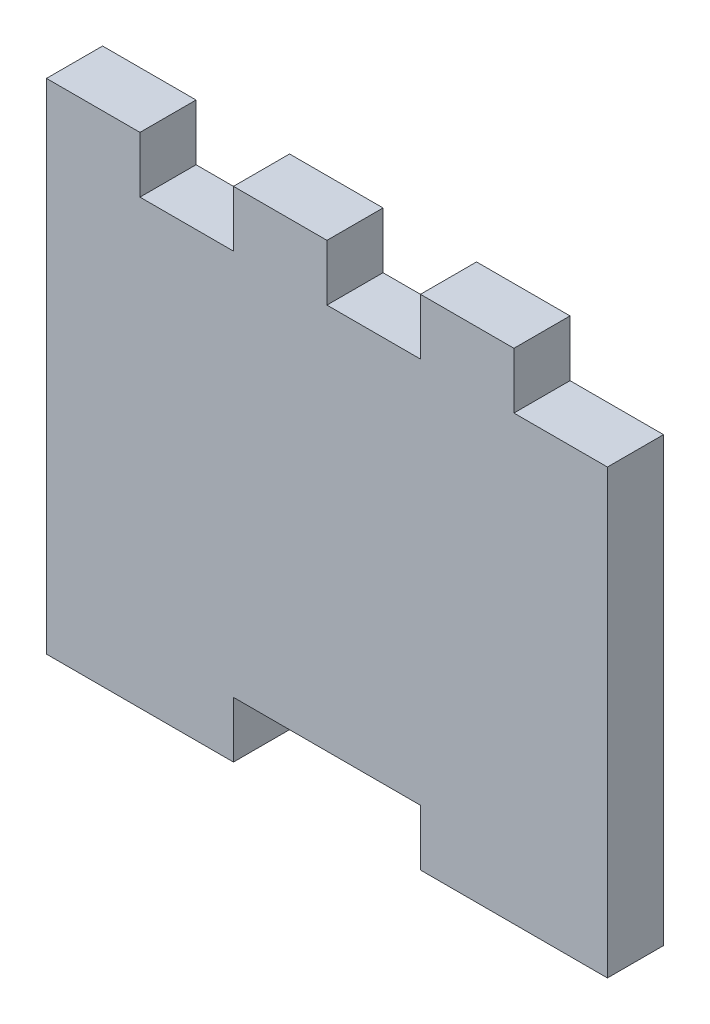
ISO-10303-21;
HEADER;
FILE_DESCRIPTION(('STEP AP214'),'2;1');
FILE_NAME('part.step','',(''),(''),'','','');
FILE_SCHEMA(('AUTOMOTIVE_DESIGN { 1 0 10303 214 1 1 1 1 }'));
ENDSEC;
DATA;
#1=APPLICATION_CONTEXT('core data for automotive mechanical design processes');
#2=APPLICATION_PROTOCOL_DEFINITION('international standard','automotive_design',2000,#1);
#3=PRODUCT_CONTEXT('',#1,'mechanical');
#4=PRODUCT('Part','Part','',(#3));
#5=PRODUCT_RELATED_PRODUCT_CATEGORY('part','',(#4));
#6=PRODUCT_DEFINITION_FORMATION('','',#4);
#7=PRODUCT_DEFINITION_CONTEXT('part definition',#1,'design');
#8=PRODUCT_DEFINITION('design','',#6,#7);
#9=PRODUCT_DEFINITION_SHAPE('','',#8);
#10=(LENGTH_UNIT() NAMED_UNIT(*) SI_UNIT(.MILLI.,.METRE.));
#11=(NAMED_UNIT(*) PLANE_ANGLE_UNIT() SI_UNIT($,.RADIAN.));
#12=(NAMED_UNIT(*) SI_UNIT($,.STERADIAN.) SOLID_ANGLE_UNIT());
#13=UNCERTAINTY_MEASURE_WITH_UNIT(LENGTH_MEASURE(1.E-05),#10,'distance_accuracy_value','');
#14=(GEOMETRIC_REPRESENTATION_CONTEXT(3) GLOBAL_UNCERTAINTY_ASSIGNED_CONTEXT((#13)) GLOBAL_UNIT_ASSIGNED_CONTEXT((#10,
#11,#12)) REPRESENTATION_CONTEXT('',''));
#15=CARTESIAN_POINT('',(0.,0.,0.));
#16=DIRECTION('',(0.,0.,1.));
#17=DIRECTION('',(1.,0.,0.));
#18=AXIS2_PLACEMENT_3D('',#15,#16,#17);
#19=CARTESIAN_POINT('',(-141.621289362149,98.5259670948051,9.));
#20=DIRECTION('',(0.,1.,0.));
#21=DIRECTION('',(-1.,0.,0.));
#22=AXIS2_PLACEMENT_3D('',#19,#20,#21);
#23=PLANE('',#22);
#24=DIRECTION('',(1.,0.,0.));
#25=VECTOR('',#24,1.);
#26=CARTESIAN_POINT('',(-141.621289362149,98.5259670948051,0.));
#27=LINE('',#26,#25);
#28=CARTESIAN_POINT('',(-141.621289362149,98.5259670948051,0.));
#29=VERTEX_POINT('',#28);
#30=CARTESIAN_POINT('',(-111.621289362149,98.5259670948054,0.));
#31=VERTEX_POINT('',#30);
#32=EDGE_CURVE('E192',#29,#31,#27,.T.);
#33=ORIENTED_EDGE('',*,*,#32,.T.);
#34=DIRECTION('',(0.,0.,-1.));
#35=VECTOR('',#34,1.);
#36=CARTESIAN_POINT('',(-111.621289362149,98.5259670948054,9.));
#37=LINE('',#36,#35);
#38=CARTESIAN_POINT('',(-111.621289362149,98.5259670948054,9.));
#39=VERTEX_POINT('',#38);
#40=EDGE_CURVE('E11',#39,#31,#37,.T.);
#41=ORIENTED_EDGE('',*,*,#40,.F.);
#42=DIRECTION('',(1.,0.,0.));
#43=VECTOR('',#42,1.);
#44=CARTESIAN_POINT('',(-141.621289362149,98.5259670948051,9.));
#45=LINE('',#44,#43);
#46=CARTESIAN_POINT('',(-141.621289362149,98.5259670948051,9.));
#47=VERTEX_POINT('',#46);
#48=EDGE_CURVE('E238',#47,#39,#45,.T.);
#49=ORIENTED_EDGE('',*,*,#48,.F.);
#50=DIRECTION('',(0.,0.,-1.));
#51=VECTOR('',#50,1.);
#52=CARTESIAN_POINT('',(-141.621289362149,98.5259670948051,9.));
#53=LINE('',#52,#51);
#54=EDGE_CURVE('E51',#47,#29,#53,.T.);
#55=ORIENTED_EDGE('',*,*,#54,.T.);
#56=EDGE_LOOP('',(#33,#41,#49,#55));
#57=FACE_BOUND('',#56,.T.);
#58=ADVANCED_FACE('F35',(#57),#23,.F.);
#59=CARTESIAN_POINT('',(-111.621289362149,98.5259670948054,9.));
#60=DIRECTION('',(-1.,0.,0.));
#61=DIRECTION('',(0.,-1.,0.));
#62=AXIS2_PLACEMENT_3D('',#59,#60,#61);
#63=PLANE('',#62);
#64=DIRECTION('',(0.,1.,0.));
#65=VECTOR('',#64,1.);
#66=CARTESIAN_POINT('',(-111.621289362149,98.5259670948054,0.));
#67=LINE('',#66,#65);
#68=CARTESIAN_POINT('',(-111.621289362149,107.525967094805,0.));
#69=VERTEX_POINT('',#68);
#70=EDGE_CURVE('E194',#31,#69,#67,.T.);
#71=ORIENTED_EDGE('',*,*,#70,.T.);
#72=DIRECTION('',(0.,0.,-1.));
#73=VECTOR('',#72,1.);
#74=CARTESIAN_POINT('',(-111.621289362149,107.525967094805,9.));
#75=LINE('',#74,#73);
#76=CARTESIAN_POINT('',(-111.621289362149,107.525967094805,9.));
#77=VERTEX_POINT('',#76);
#78=EDGE_CURVE('E43',#77,#69,#75,.T.);
#79=ORIENTED_EDGE('',*,*,#78,.F.);
#80=DIRECTION('',(0.,1.,0.));
#81=VECTOR('',#80,1.);
#82=CARTESIAN_POINT('',(-111.621289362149,98.5259670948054,9.));
#83=LINE('',#82,#81);
#84=EDGE_CURVE('E119',#39,#77,#83,.T.);
#85=ORIENTED_EDGE('',*,*,#84,.F.);
#86=ORIENTED_EDGE('',*,*,#40,.T.);
#87=EDGE_LOOP('',(#71,#79,#85,#86));
#88=FACE_BOUND('',#87,.T.);
#89=ADVANCED_FACE('F335',(#88),#63,.F.);
#90=CARTESIAN_POINT('',(-111.621289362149,107.525967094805,9.));
#91=DIRECTION('',(0.,1.,0.));
#92=DIRECTION('',(-1.,0.,0.));
#93=AXIS2_PLACEMENT_3D('',#90,#91,#92);
#94=PLANE('',#93);
#95=DIRECTION('',(1.,0.,0.));
#96=VECTOR('',#95,1.);
#97=CARTESIAN_POINT('',(-111.621289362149,107.525967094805,0.));
#98=LINE('',#97,#96);
#99=CARTESIAN_POINT('',(-81.621289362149,107.525967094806,0.));
#100=VERTEX_POINT('',#99);
#101=EDGE_CURVE('E196',#69,#100,#98,.T.);
#102=ORIENTED_EDGE('',*,*,#101,.T.);
#103=DIRECTION('',(0.,0.,-1.));
#104=VECTOR('',#103,1.);
#105=CARTESIAN_POINT('',(-81.621289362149,107.525967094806,9.));
#106=LINE('',#105,#104);
#107=CARTESIAN_POINT('',(-81.621289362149,107.525967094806,9.));
#108=VERTEX_POINT('',#107);
#109=EDGE_CURVE('E266',#108,#100,#106,.T.);
#110=ORIENTED_EDGE('',*,*,#109,.F.);
#111=DIRECTION('',(1.,0.,0.));
#112=VECTOR('',#111,1.);
#113=CARTESIAN_POINT('',(-111.621289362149,107.525967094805,9.));
#114=LINE('',#113,#112);
#115=EDGE_CURVE('E274',#77,#108,#114,.T.);
#116=ORIENTED_EDGE('',*,*,#115,.F.);
#117=ORIENTED_EDGE('',*,*,#78,.T.);
#118=EDGE_LOOP('',(#102,#110,#116,#117));
#119=FACE_BOUND('',#118,.T.);
#120=ADVANCED_FACE('F272',(#119),#94,.F.);
#121=CARTESIAN_POINT('',(-81.621289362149,107.525967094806,9.));
#122=DIRECTION('',(1.,0.,0.));
#123=DIRECTION('',(0.,1.,0.));
#124=AXIS2_PLACEMENT_3D('',#121,#122,#123);
#125=PLANE('',#124);
#126=DIRECTION('',(0.,-1.,0.));
#127=VECTOR('',#126,1.);
#128=CARTESIAN_POINT('',(-81.621289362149,107.525967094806,0.));
#129=LINE('',#128,#127);
#130=CARTESIAN_POINT('',(-81.6212893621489,98.5259670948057,0.));
#131=VERTEX_POINT('',#130);
#132=EDGE_CURVE('E198',#100,#131,#129,.T.);
#133=ORIENTED_EDGE('',*,*,#132,.T.);
#134=DIRECTION('',(0.,0.,-1.));
#135=VECTOR('',#134,1.);
#136=CARTESIAN_POINT('',(-81.6212893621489,98.5259670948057,9.));
#137=LINE('',#136,#135);
#138=CARTESIAN_POINT('',(-81.6212893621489,98.5259670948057,9.));
#139=VERTEX_POINT('',#138);
#140=EDGE_CURVE('E263',#139,#131,#137,.T.);
#141=ORIENTED_EDGE('',*,*,#140,.F.);
#142=DIRECTION('',(0.,-1.,0.));
#143=VECTOR('',#142,1.);
#144=CARTESIAN_POINT('',(-81.621289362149,107.525967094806,9.));
#145=LINE('',#144,#143);
#146=EDGE_CURVE('E291',#108,#139,#145,.T.);
#147=ORIENTED_EDGE('',*,*,#146,.F.);
#148=ORIENTED_EDGE('',*,*,#109,.T.);
#149=EDGE_LOOP('',(#133,#141,#147,#148));
#150=FACE_BOUND('',#149,.T.);
#151=ADVANCED_FACE('F282',(#150),#125,.F.);
#152=CARTESIAN_POINT('',(-81.6212893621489,98.5259670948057,9.));
#153=DIRECTION('',(0.,1.,0.));
#154=DIRECTION('',(-1.,0.,0.));
#155=AXIS2_PLACEMENT_3D('',#152,#153,#154);
#156=PLANE('',#155);
#157=DIRECTION('',(1.,0.,0.));
#158=VECTOR('',#157,1.);
#159=CARTESIAN_POINT('',(-81.6212893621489,98.5259670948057,0.));
#160=LINE('',#159,#158);
#161=CARTESIAN_POINT('',(-51.6212893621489,98.525967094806,0.));
#162=VERTEX_POINT('',#161);
#163=EDGE_CURVE('E200',#131,#162,#160,.T.);
#164=ORIENTED_EDGE('',*,*,#163,.T.);
#165=DIRECTION('',(0.,0.,-1.));
#166=VECTOR('',#165,1.);
#167=CARTESIAN_POINT('',(-51.6212893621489,98.525967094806,9.));
#168=LINE('',#167,#166);
#169=CARTESIAN_POINT('',(-51.6212893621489,98.525967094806,9.));
#170=VERTEX_POINT('',#169);
#171=EDGE_CURVE('E260',#170,#162,#168,.T.);
#172=ORIENTED_EDGE('',*,*,#171,.F.);
#173=DIRECTION('',(1.,0.,0.));
#174=VECTOR('',#173,1.);
#175=CARTESIAN_POINT('',(-81.6212893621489,98.5259670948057,9.));
#176=LINE('',#175,#174);
#177=EDGE_CURVE('E288',#139,#170,#176,.T.);
#178=ORIENTED_EDGE('',*,*,#177,.F.);
#179=ORIENTED_EDGE('',*,*,#140,.T.);
#180=EDGE_LOOP('',(#164,#172,#178,#179));
#181=FACE_BOUND('',#180,.T.);
#182=ADVANCED_FACE('F286',(#181),#156,.F.);
#183=CARTESIAN_POINT('',(-51.6212893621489,98.525967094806,9.));
#184=DIRECTION('',(-1.,0.,0.));
#185=DIRECTION('',(0.,0.,1.));
#186=AXIS2_PLACEMENT_3D('',#183,#184,#185);
#187=PLANE('',#186);
#188=DIRECTION('',(0.,1.,0.));
#189=VECTOR('',#188,1.);
#190=CARTESIAN_POINT('',(-51.6212893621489,98.525967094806,0.));
#191=LINE('',#190,#189);
#192=CARTESIAN_POINT('',(-51.6212893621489,169.525967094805,0.));
#193=VERTEX_POINT('',#192);
#194=EDGE_CURVE('E202',#162,#193,#191,.T.);
#195=ORIENTED_EDGE('',*,*,#194,.T.);
#196=DIRECTION('',(0.,0.,-1.));
#197=VECTOR('',#196,1.);
#198=CARTESIAN_POINT('',(-51.6212893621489,169.525967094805,9.));
#199=LINE('',#198,#197);
#200=CARTESIAN_POINT('',(-51.6212893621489,169.525967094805,9.));
#201=VERTEX_POINT('',#200);
#202=EDGE_CURVE('E258',#201,#193,#199,.T.);
#203=ORIENTED_EDGE('',*,*,#202,.F.);
#204=DIRECTION('',(0.,1.,0.));
#205=VECTOR('',#204,1.);
#206=CARTESIAN_POINT('',(-51.6212893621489,98.525967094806,9.));
#207=LINE('',#206,#205);
#208=EDGE_CURVE('E290',#170,#201,#207,.T.);
#209=ORIENTED_EDGE('',*,*,#208,.F.);
#210=ORIENTED_EDGE('',*,*,#171,.T.);
#211=EDGE_LOOP('',(#195,#203,#209,#210));
#212=FACE_BOUND('',#211,.T.);
#213=ADVANCED_FACE('F351',(#212),#187,.F.);
#214=CARTESIAN_POINT('',(-66.6212893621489,169.525967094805,9.));
#215=DIRECTION('',(0.,1.,0.));
#216=DIRECTION('',(0.,0.,1.));
#217=AXIS2_PLACEMENT_3D('',#214,#215,#216);
#218=PLANE('',#217);
#219=DIRECTION('',(1.,0.,0.));
#220=VECTOR('',#219,1.);
#221=CARTESIAN_POINT('',(-66.6212893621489,169.525967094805,0.));
#222=LINE('',#221,#220);
#223=CARTESIAN_POINT('',(-66.6212893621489,169.525967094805,0.));
#224=VERTEX_POINT('',#223);
#225=EDGE_CURVE('E205',#224,#193,#222,.T.);
#226=ORIENTED_EDGE('',*,*,#225,.F.);
#227=DIRECTION('',(0.,0.,-1.));
#228=VECTOR('',#227,1.);
#229=CARTESIAN_POINT('',(-66.6212893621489,169.525967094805,9.));
#230=LINE('',#229,#228);
#231=CARTESIAN_POINT('',(-66.6212893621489,169.525967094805,9.));
#232=VERTEX_POINT('',#231);
#233=EDGE_CURVE('E256',#232,#224,#230,.T.);
#234=ORIENTED_EDGE('',*,*,#233,.F.);
#235=DIRECTION('',(1.,0.,0.));
#236=VECTOR('',#235,1.);
#237=CARTESIAN_POINT('',(-66.6212893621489,169.525967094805,9.));
#238=LINE('',#237,#236);
#239=EDGE_CURVE('E293',#232,#201,#238,.T.);
#240=ORIENTED_EDGE('',*,*,#239,.T.);
#241=ORIENTED_EDGE('',*,*,#202,.T.);
#242=EDGE_LOOP('',(#226,#234,#240,#241));
#243=FACE_BOUND('',#242,.T.);
#244=ADVANCED_FACE('F354',(#243),#218,.T.);
#245=CARTESIAN_POINT('',(-66.6212893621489,178.525967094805,9.));
#246=DIRECTION('',(1.,0.,0.));
#247=DIRECTION('',(0.,0.,-1.));
#248=AXIS2_PLACEMENT_3D('',#245,#246,#247);
#249=PLANE('',#248);
#250=DIRECTION('',(0.,-1.,0.));
#251=VECTOR('',#250,1.);
#252=CARTESIAN_POINT('',(-66.6212893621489,178.525967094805,0.));
#253=LINE('',#252,#251);
#254=CARTESIAN_POINT('',(-66.6212893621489,178.525967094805,0.));
#255=VERTEX_POINT('',#254);
#256=EDGE_CURVE('E208',#255,#224,#253,.T.);
#257=ORIENTED_EDGE('',*,*,#256,.F.);
#258=DIRECTION('',(0.,0.,-1.));
#259=VECTOR('',#258,1.);
#260=CARTESIAN_POINT('',(-66.6212893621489,178.525967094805,9.));
#261=LINE('',#260,#259);
#262=CARTESIAN_POINT('',(-66.6212893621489,178.525967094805,9.));
#263=VERTEX_POINT('',#262);
#264=EDGE_CURVE('E254',#263,#255,#261,.T.);
#265=ORIENTED_EDGE('',*,*,#264,.F.);
#266=DIRECTION('',(0.,-1.,0.));
#267=VECTOR('',#266,1.);
#268=CARTESIAN_POINT('',(-66.6212893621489,178.525967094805,9.));
#269=LINE('',#268,#267);
#270=EDGE_CURVE('E300',#263,#232,#269,.T.);
#271=ORIENTED_EDGE('',*,*,#270,.T.);
#272=ORIENTED_EDGE('',*,*,#233,.T.);
#273=EDGE_LOOP('',(#257,#265,#271,#272));
#274=FACE_BOUND('',#273,.T.);
#275=ADVANCED_FACE('F358',(#274),#249,.T.);
#276=CARTESIAN_POINT('',(-81.621289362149,178.525967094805,9.));
#277=DIRECTION('',(0.,1.,0.));
#278=DIRECTION('',(0.,0.,1.));
#279=AXIS2_PLACEMENT_3D('',#276,#277,#278);
#280=PLANE('',#279);
#281=DIRECTION('',(1.,0.,0.));
#282=VECTOR('',#281,1.);
#283=CARTESIAN_POINT('',(-81.621289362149,178.525967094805,0.));
#284=LINE('',#283,#282);
#285=CARTESIAN_POINT('',(-81.621289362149,178.525967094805,0.));
#286=VERTEX_POINT('',#285);
#287=EDGE_CURVE('E211',#286,#255,#284,.T.);
#288=ORIENTED_EDGE('',*,*,#287,.F.);
#289=DIRECTION('',(0.,0.,-1.));
#290=VECTOR('',#289,1.);
#291=CARTESIAN_POINT('',(-81.621289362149,178.525967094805,9.));
#292=LINE('',#291,#290);
#293=CARTESIAN_POINT('',(-81.621289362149,178.525967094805,9.));
#294=VERTEX_POINT('',#293);
#295=EDGE_CURVE('E252',#294,#286,#292,.T.);
#296=ORIENTED_EDGE('',*,*,#295,.F.);
#297=DIRECTION('',(1.,0.,0.));
#298=VECTOR('',#297,1.);
#299=CARTESIAN_POINT('',(-81.621289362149,178.525967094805,9.));
#300=LINE('',#299,#298);
#301=EDGE_CURVE('E303',#294,#263,#300,.T.);
#302=ORIENTED_EDGE('',*,*,#301,.T.);
#303=ORIENTED_EDGE('',*,*,#264,.T.);
#304=EDGE_LOOP('',(#288,#296,#302,#303));
#305=FACE_BOUND('',#304,.T.);
#306=ADVANCED_FACE('F362',(#305),#280,.T.);
#307=CARTESIAN_POINT('',(-81.621289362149,169.525967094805,9.));
#308=DIRECTION('',(-1.,0.,0.));
#309=DIRECTION('',(0.,0.,1.));
#310=AXIS2_PLACEMENT_3D('',#307,#308,#309);
#311=PLANE('',#310);
#312=DIRECTION('',(0.,1.,0.));
#313=VECTOR('',#312,1.);
#314=CARTESIAN_POINT('',(-81.621289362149,169.525967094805,0.));
#315=LINE('',#314,#313);
#316=CARTESIAN_POINT('',(-81.621289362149,169.525967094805,0.));
#317=VERTEX_POINT('',#316);
#318=EDGE_CURVE('E214',#317,#286,#315,.T.);
#319=ORIENTED_EDGE('',*,*,#318,.F.);
#320=DIRECTION('',(0.,0.,-1.));
#321=VECTOR('',#320,1.);
#322=CARTESIAN_POINT('',(-81.621289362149,169.525967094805,9.));
#323=LINE('',#322,#321);
#324=CARTESIAN_POINT('',(-81.621289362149,169.525967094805,9.));
#325=VERTEX_POINT('',#324);
#326=EDGE_CURVE('E250',#325,#317,#323,.T.);
#327=ORIENTED_EDGE('',*,*,#326,.F.);
#328=DIRECTION('',(0.,1.,0.));
#329=VECTOR('',#328,1.);
#330=CARTESIAN_POINT('',(-81.621289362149,169.525967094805,9.));
#331=LINE('',#330,#329);
#332=EDGE_CURVE('E306',#325,#294,#331,.T.);
#333=ORIENTED_EDGE('',*,*,#332,.T.);
#334=ORIENTED_EDGE('',*,*,#295,.T.);
#335=EDGE_LOOP('',(#319,#327,#333,#334));
#336=FACE_BOUND('',#335,.T.);
#337=ADVANCED_FACE('F366',(#336),#311,.T.);
#338=CARTESIAN_POINT('',(-96.6212893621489,169.525967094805,9.));
#339=DIRECTION('',(0.,1.,0.));
#340=DIRECTION('',(0.,0.,1.));
#341=AXIS2_PLACEMENT_3D('',#338,#339,#340);
#342=PLANE('',#341);
#343=DIRECTION('',(1.,0.,0.));
#344=VECTOR('',#343,1.);
#345=CARTESIAN_POINT('',(-96.6212893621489,169.525967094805,0.));
#346=LINE('',#345,#344);
#347=CARTESIAN_POINT('',(-96.6212893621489,169.525967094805,0.));
#348=VERTEX_POINT('',#347);
#349=EDGE_CURVE('E217',#348,#317,#346,.T.);
#350=ORIENTED_EDGE('',*,*,#349,.F.);
#351=DIRECTION('',(0.,0.,-1.));
#352=VECTOR('',#351,1.);
#353=CARTESIAN_POINT('',(-96.6212893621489,169.525967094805,9.));
#354=LINE('',#353,#352);
#355=CARTESIAN_POINT('',(-96.6212893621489,169.525967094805,9.));
#356=VERTEX_POINT('',#355);
#357=EDGE_CURVE('E248',#356,#348,#354,.T.);
#358=ORIENTED_EDGE('',*,*,#357,.F.);
#359=DIRECTION('',(1.,0.,0.));
#360=VECTOR('',#359,1.);
#361=CARTESIAN_POINT('',(-96.6212893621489,169.525967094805,9.));
#362=LINE('',#361,#360);
#363=EDGE_CURVE('E309',#356,#325,#362,.T.);
#364=ORIENTED_EDGE('',*,*,#363,.T.);
#365=ORIENTED_EDGE('',*,*,#326,.T.);
#366=EDGE_LOOP('',(#350,#358,#364,#365));
#367=FACE_BOUND('',#366,.T.);
#368=ADVANCED_FACE('F370',(#367),#342,.T.);
#369=CARTESIAN_POINT('',(-96.6212893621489,178.525967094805,9.));
#370=DIRECTION('',(1.,0.,0.));
#371=DIRECTION('',(0.,0.,-1.));
#372=AXIS2_PLACEMENT_3D('',#369,#370,#371);
#373=PLANE('',#372);
#374=DIRECTION('',(0.,-1.,0.));
#375=VECTOR('',#374,1.);
#376=CARTESIAN_POINT('',(-96.6212893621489,178.525967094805,0.));
#377=LINE('',#376,#375);
#378=CARTESIAN_POINT('',(-96.6212893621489,178.525967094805,0.));
#379=VERTEX_POINT('',#378);
#380=EDGE_CURVE('E220',#379,#348,#377,.T.);
#381=ORIENTED_EDGE('',*,*,#380,.F.);
#382=DIRECTION('',(0.,0.,-1.));
#383=VECTOR('',#382,1.);
#384=CARTESIAN_POINT('',(-96.6212893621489,178.525967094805,9.));
#385=LINE('',#384,#383);
#386=CARTESIAN_POINT('',(-96.6212893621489,178.525967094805,9.));
#387=VERTEX_POINT('',#386);
#388=EDGE_CURVE('E246',#387,#379,#385,.T.);
#389=ORIENTED_EDGE('',*,*,#388,.F.);
#390=DIRECTION('',(0.,-1.,0.));
#391=VECTOR('',#390,1.);
#392=CARTESIAN_POINT('',(-96.6212893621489,178.525967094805,9.));
#393=LINE('',#392,#391);
#394=EDGE_CURVE('E312',#387,#356,#393,.T.);
#395=ORIENTED_EDGE('',*,*,#394,.T.);
#396=ORIENTED_EDGE('',*,*,#357,.T.);
#397=EDGE_LOOP('',(#381,#389,#395,#396));
#398=FACE_BOUND('',#397,.T.);
#399=ADVANCED_FACE('F374',(#398),#373,.T.);
#400=CARTESIAN_POINT('',(-111.621289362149,178.525967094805,9.));
#401=DIRECTION('',(0.,1.,0.));
#402=DIRECTION('',(0.,0.,1.));
#403=AXIS2_PLACEMENT_3D('',#400,#401,#402);
#404=PLANE('',#403);
#405=DIRECTION('',(1.,0.,0.));
#406=VECTOR('',#405,1.);
#407=CARTESIAN_POINT('',(-111.621289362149,178.525967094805,0.));
#408=LINE('',#407,#406);
#409=CARTESIAN_POINT('',(-111.621289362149,178.525967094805,0.));
#410=VERTEX_POINT('',#409);
#411=EDGE_CURVE('E223',#410,#379,#408,.T.);
#412=ORIENTED_EDGE('',*,*,#411,.F.);
#413=DIRECTION('',(0.,0.,-1.));
#414=VECTOR('',#413,1.);
#415=CARTESIAN_POINT('',(-111.621289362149,178.525967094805,9.));
#416=LINE('',#415,#414);
#417=CARTESIAN_POINT('',(-111.621289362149,178.525967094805,9.));
#418=VERTEX_POINT('',#417);
#419=EDGE_CURVE('E244',#418,#410,#416,.T.);
#420=ORIENTED_EDGE('',*,*,#419,.F.);
#421=DIRECTION('',(1.,0.,0.));
#422=VECTOR('',#421,1.);
#423=CARTESIAN_POINT('',(-111.621289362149,178.525967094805,9.));
#424=LINE('',#423,#422);
#425=EDGE_CURVE('E315',#418,#387,#424,.T.);
#426=ORIENTED_EDGE('',*,*,#425,.T.);
#427=ORIENTED_EDGE('',*,*,#388,.T.);
#428=EDGE_LOOP('',(#412,#420,#426,#427));
#429=FACE_BOUND('',#428,.T.);
#430=ADVANCED_FACE('F378',(#429),#404,.T.);
#431=CARTESIAN_POINT('',(-111.621289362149,169.525967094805,9.));
#432=DIRECTION('',(-1.,0.,0.));
#433=DIRECTION('',(0.,0.,1.));
#434=AXIS2_PLACEMENT_3D('',#431,#432,#433);
#435=PLANE('',#434);
#436=DIRECTION('',(0.,1.,0.));
#437=VECTOR('',#436,1.);
#438=CARTESIAN_POINT('',(-111.621289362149,169.525967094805,0.));
#439=LINE('',#438,#437);
#440=CARTESIAN_POINT('',(-111.621289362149,169.525967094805,0.));
#441=VERTEX_POINT('',#440);
#442=EDGE_CURVE('E226',#441,#410,#439,.T.);
#443=ORIENTED_EDGE('',*,*,#442,.F.);
#444=DIRECTION('',(0.,0.,-1.));
#445=VECTOR('',#444,1.);
#446=CARTESIAN_POINT('',(-111.621289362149,169.525967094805,9.));
#447=LINE('',#446,#445);
#448=CARTESIAN_POINT('',(-111.621289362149,169.525967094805,9.));
#449=VERTEX_POINT('',#448);
#450=EDGE_CURVE('E242',#449,#441,#447,.T.);
#451=ORIENTED_EDGE('',*,*,#450,.F.);
#452=DIRECTION('',(0.,1.,0.));
#453=VECTOR('',#452,1.);
#454=CARTESIAN_POINT('',(-111.621289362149,169.525967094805,9.));
#455=LINE('',#454,#453);
#456=EDGE_CURVE('E318',#449,#418,#455,.T.);
#457=ORIENTED_EDGE('',*,*,#456,.T.);
#458=ORIENTED_EDGE('',*,*,#419,.T.);
#459=EDGE_LOOP('',(#443,#451,#457,#458));
#460=FACE_BOUND('',#459,.T.);
#461=ADVANCED_FACE('F382',(#460),#435,.T.);
#462=CARTESIAN_POINT('',(-126.621289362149,169.525967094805,9.));
#463=DIRECTION('',(0.,1.,0.));
#464=DIRECTION('',(0.,0.,1.));
#465=AXIS2_PLACEMENT_3D('',#462,#463,#464);
#466=PLANE('',#465);
#467=DIRECTION('',(1.,0.,0.));
#468=VECTOR('',#467,1.);
#469=CARTESIAN_POINT('',(-126.621289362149,169.525967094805,0.));
#470=LINE('',#469,#468);
#471=CARTESIAN_POINT('',(-126.621289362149,169.525967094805,0.));
#472=VERTEX_POINT('',#471);
#473=EDGE_CURVE('E229',#472,#441,#470,.T.);
#474=ORIENTED_EDGE('',*,*,#473,.F.);
#475=DIRECTION('',(0.,0.,-1.));
#476=VECTOR('',#475,1.);
#477=CARTESIAN_POINT('',(-126.621289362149,169.525967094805,9.));
#478=LINE('',#477,#476);
#479=CARTESIAN_POINT('',(-126.621289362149,169.525967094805,9.));
#480=VERTEX_POINT('',#479);
#481=EDGE_CURVE('E174',#480,#472,#478,.T.);
#482=ORIENTED_EDGE('',*,*,#481,.F.);
#483=DIRECTION('',(1.,0.,0.));
#484=VECTOR('',#483,1.);
#485=CARTESIAN_POINT('',(-126.621289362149,169.525967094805,9.));
#486=LINE('',#485,#484);
#487=EDGE_CURVE('E184',#480,#449,#486,.T.);
#488=ORIENTED_EDGE('',*,*,#487,.T.);
#489=ORIENTED_EDGE('',*,*,#450,.T.);
#490=EDGE_LOOP('',(#474,#482,#488,#489));
#491=FACE_BOUND('',#490,.T.);
#492=ADVANCED_FACE('F322',(#491),#466,.T.);
#493=CARTESIAN_POINT('',(-126.621289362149,178.525967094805,9.));
#494=DIRECTION('',(1.,0.,0.));
#495=DIRECTION('',(0.,0.,-1.));
#496=AXIS2_PLACEMENT_3D('',#493,#494,#495);
#497=PLANE('',#496);
#498=DIRECTION('',(0.,-1.,0.));
#499=VECTOR('',#498,1.);
#500=CARTESIAN_POINT('',(-126.621289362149,178.525967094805,0.));
#501=LINE('',#500,#499);
#502=CARTESIAN_POINT('',(-126.621289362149,178.525967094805,0.));
#503=VERTEX_POINT('',#502);
#504=EDGE_CURVE('E170',#503,#472,#501,.T.);
#505=ORIENTED_EDGE('',*,*,#504,.F.);
#506=DIRECTION('',(0.,0.,-1.));
#507=VECTOR('',#506,1.);
#508=CARTESIAN_POINT('',(-126.621289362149,178.525967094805,9.));
#509=LINE('',#508,#507);
#510=CARTESIAN_POINT('',(-126.621289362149,178.525967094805,9.));
#511=VERTEX_POINT('',#510);
#512=EDGE_CURVE('E165',#511,#503,#509,.T.);
#513=ORIENTED_EDGE('',*,*,#512,.F.);
#514=DIRECTION('',(0.,-1.,0.));
#515=VECTOR('',#514,1.);
#516=CARTESIAN_POINT('',(-126.621289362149,178.525967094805,9.));
#517=LINE('',#516,#515);
#518=EDGE_CURVE('E168',#511,#480,#517,.T.);
#519=ORIENTED_EDGE('',*,*,#518,.T.);
#520=ORIENTED_EDGE('',*,*,#481,.T.);
#521=EDGE_LOOP('',(#505,#513,#519,#520));
#522=FACE_BOUND('',#521,.T.);
#523=ADVANCED_FACE('F167',(#522),#497,.T.);
#524=CARTESIAN_POINT('',(-141.621289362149,178.525967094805,9.));
#525=DIRECTION('',(0.,1.,0.));
#526=DIRECTION('',(0.,0.,1.));
#527=AXIS2_PLACEMENT_3D('',#524,#525,#526);
#528=PLANE('',#527);
#529=DIRECTION('',(1.,0.,0.));
#530=VECTOR('',#529,1.);
#531=CARTESIAN_POINT('',(-141.621289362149,178.525967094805,0.));
#532=LINE('',#531,#530);
#533=CARTESIAN_POINT('',(-141.621289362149,178.525967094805,0.));
#534=VERTEX_POINT('',#533);
#535=EDGE_CURVE('E233',#534,#503,#532,.T.);
#536=ORIENTED_EDGE('',*,*,#535,.F.);
#537=DIRECTION('',(0.,0.,-1.));
#538=VECTOR('',#537,1.);
#539=CARTESIAN_POINT('',(-141.621289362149,178.525967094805,9.));
#540=LINE('',#539,#538);
#541=CARTESIAN_POINT('',(-141.621289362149,178.525967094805,9.));
#542=VERTEX_POINT('',#541);
#543=EDGE_CURVE('E107',#542,#534,#540,.T.);
#544=ORIENTED_EDGE('',*,*,#543,.F.);
#545=DIRECTION('',(1.,0.,0.));
#546=VECTOR('',#545,1.);
#547=CARTESIAN_POINT('',(-141.621289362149,178.525967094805,9.));
#548=LINE('',#547,#546);
#549=EDGE_CURVE('E181',#542,#511,#548,.T.);
#550=ORIENTED_EDGE('',*,*,#549,.T.);
#551=ORIENTED_EDGE('',*,*,#512,.T.);
#552=EDGE_LOOP('',(#536,#544,#550,#551));
#553=FACE_BOUND('',#552,.T.);
#554=ADVANCED_FACE('F186',(#553),#528,.T.);
#555=CARTESIAN_POINT('',(-141.621289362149,98.5259670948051,9.));
#556=DIRECTION('',(-1.,0.,0.));
#557=DIRECTION('',(0.,0.,1.));
#558=AXIS2_PLACEMENT_3D('',#555,#556,#557);
#559=PLANE('',#558);
#560=DIRECTION('',(0.,1.,0.));
#561=VECTOR('',#560,1.);
#562=CARTESIAN_POINT('',(-141.621289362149,98.5259670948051,0.));
#563=LINE('',#562,#561);
#564=EDGE_CURVE('E235',#29,#534,#563,.T.);
#565=ORIENTED_EDGE('',*,*,#564,.F.);
#566=ORIENTED_EDGE('',*,*,#54,.F.);
#567=DIRECTION('',(0.,1.,0.));
#568=VECTOR('',#567,1.);
#569=CARTESIAN_POINT('',(-141.621289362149,98.5259670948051,9.));
#570=LINE('',#569,#568);
#571=EDGE_CURVE('E187',#47,#542,#570,.T.);
#572=ORIENTED_EDGE('',*,*,#571,.T.);
#573=ORIENTED_EDGE('',*,*,#543,.T.);
#574=EDGE_LOOP('',(#565,#566,#572,#573));
#575=FACE_BOUND('',#574,.T.);
#576=ADVANCED_FACE('F324',(#575),#559,.T.);
#577=CARTESIAN_POINT('',(0.,0.,9.));
#578=DIRECTION('',(0.,0.,1.));
#579=DIRECTION('',(1.,0.,0.));
#580=AXIS2_PLACEMENT_3D('',#577,#578,#579);
#581=PLANE('',#580);
#582=ORIENTED_EDGE('',*,*,#48,.T.);
#583=ORIENTED_EDGE('',*,*,#84,.T.);
#584=ORIENTED_EDGE('',*,*,#115,.T.);
#585=ORIENTED_EDGE('',*,*,#146,.T.);
#586=ORIENTED_EDGE('',*,*,#177,.T.);
#587=ORIENTED_EDGE('',*,*,#208,.T.);
#588=ORIENTED_EDGE('',*,*,#239,.F.);
#589=ORIENTED_EDGE('',*,*,#270,.F.);
#590=ORIENTED_EDGE('',*,*,#301,.F.);
#591=ORIENTED_EDGE('',*,*,#332,.F.);
#592=ORIENTED_EDGE('',*,*,#363,.F.);
#593=ORIENTED_EDGE('',*,*,#394,.F.);
#594=ORIENTED_EDGE('',*,*,#425,.F.);
#595=ORIENTED_EDGE('',*,*,#456,.F.);
#596=ORIENTED_EDGE('',*,*,#487,.F.);
#597=ORIENTED_EDGE('',*,*,#518,.F.);
#598=ORIENTED_EDGE('',*,*,#549,.F.);
#599=ORIENTED_EDGE('',*,*,#571,.F.);
#600=EDGE_LOOP('',(#582,#583,#584,#585,#586,#587,#588,#589,#590,#591,#592,#593,#594,#595,#596,
#597,#598,#599));
#601=FACE_BOUND('',#600,.T.);
#602=ADVANCED_FACE('F179',(#601),#581,.T.);
#603=CARTESIAN_POINT('',(0.,0.,0.));
#604=DIRECTION('',(0.,0.,1.));
#605=DIRECTION('',(1.,0.,0.));
#606=AXIS2_PLACEMENT_3D('',#603,#604,#605);
#607=PLANE('',#606);
#608=ORIENTED_EDGE('',*,*,#32,.F.);
#609=ORIENTED_EDGE('',*,*,#564,.T.);
#610=ORIENTED_EDGE('',*,*,#535,.T.);
#611=ORIENTED_EDGE('',*,*,#504,.T.);
#612=ORIENTED_EDGE('',*,*,#473,.T.);
#613=ORIENTED_EDGE('',*,*,#442,.T.);
#614=ORIENTED_EDGE('',*,*,#411,.T.);
#615=ORIENTED_EDGE('',*,*,#380,.T.);
#616=ORIENTED_EDGE('',*,*,#349,.T.);
#617=ORIENTED_EDGE('',*,*,#318,.T.);
#618=ORIENTED_EDGE('',*,*,#287,.T.);
#619=ORIENTED_EDGE('',*,*,#256,.T.);
#620=ORIENTED_EDGE('',*,*,#225,.T.);
#621=ORIENTED_EDGE('',*,*,#194,.F.);
#622=ORIENTED_EDGE('',*,*,#163,.F.);
#623=ORIENTED_EDGE('',*,*,#132,.F.);
#624=ORIENTED_EDGE('',*,*,#101,.F.);
#625=ORIENTED_EDGE('',*,*,#70,.F.);
#626=EDGE_LOOP('',(#608,#609,#610,#611,#612,#613,#614,#615,#616,#617,#618,#619,#620,#621,#622,
#623,#624,#625));
#627=FACE_BOUND('',#626,.T.);
#628=ADVANCED_FACE('F277',(#627),#607,.F.);
#629=CLOSED_SHELL('',(#58,#89,#120,#151,#182,#213,#244,#275,#306,#337,#368,#399,#430,#461,#492,
#523,#554,#576,#602,#628));
#630=MANIFOLD_SOLID_BREP('B2',#629);
#631=ADVANCED_BREP_SHAPE_REPRESENTATION('',(#18,#630),#14);
#632=SHAPE_DEFINITION_REPRESENTATION(#9,#631);
ENDSEC;
END-ISO-10303-21;
